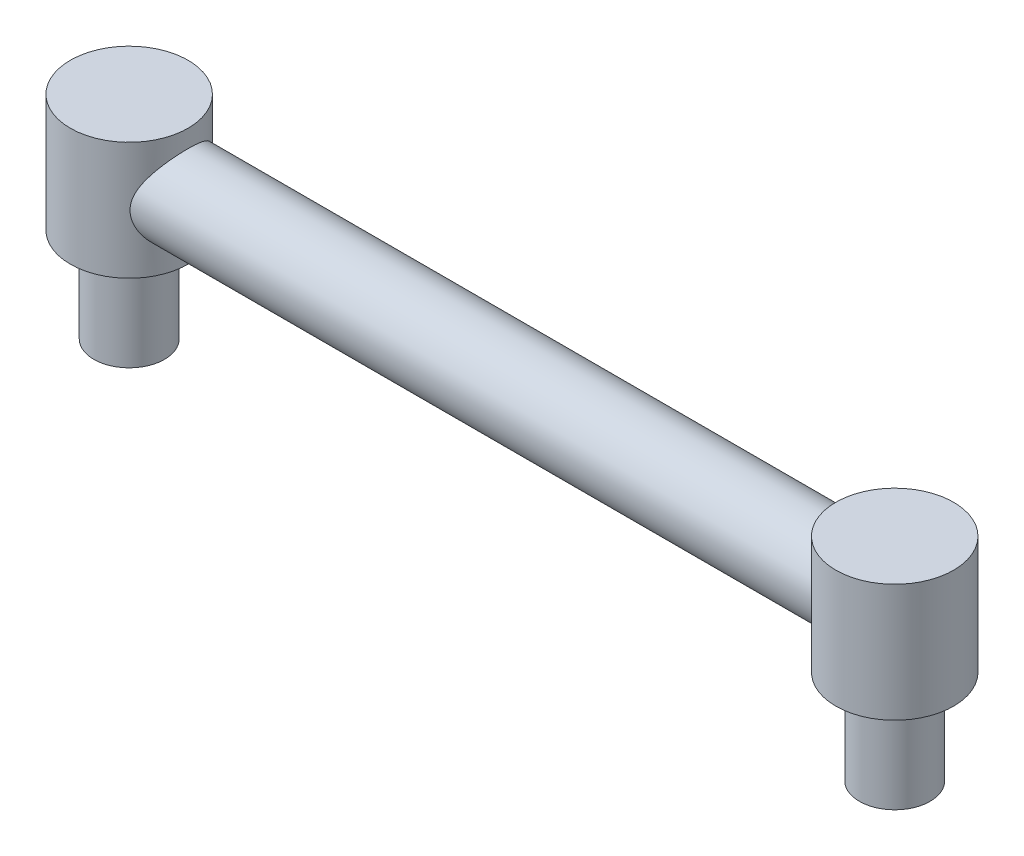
ISO-10303-21;
HEADER;
FILE_DESCRIPTION(('STEP AP214'),'2;1');
FILE_NAME('part.step','',(''),(''),'','','');
FILE_SCHEMA(('AUTOMOTIVE_DESIGN { 1 0 10303 214 1 1 1 1 }'));
ENDSEC;
DATA;
#1=APPLICATION_CONTEXT('core data for automotive mechanical design processes');
#2=APPLICATION_PROTOCOL_DEFINITION('international standard','automotive_design',2000,#1);
#3=PRODUCT_CONTEXT('',#1,'mechanical');
#4=PRODUCT('Part','Part','',(#3));
#5=PRODUCT_RELATED_PRODUCT_CATEGORY('part','',(#4));
#6=PRODUCT_DEFINITION_FORMATION('','',#4);
#7=PRODUCT_DEFINITION_CONTEXT('part definition',#1,'design');
#8=PRODUCT_DEFINITION('design','',#6,#7);
#9=PRODUCT_DEFINITION_SHAPE('','',#8);
#10=(LENGTH_UNIT() NAMED_UNIT(*) SI_UNIT(.MILLI.,.METRE.));
#11=(NAMED_UNIT(*) PLANE_ANGLE_UNIT() SI_UNIT($,.RADIAN.));
#12=(NAMED_UNIT(*) SI_UNIT($,.STERADIAN.) SOLID_ANGLE_UNIT());
#13=UNCERTAINTY_MEASURE_WITH_UNIT(LENGTH_MEASURE(1.E-05),#10,'distance_accuracy_value','');
#14=(GEOMETRIC_REPRESENTATION_CONTEXT(3) GLOBAL_UNCERTAINTY_ASSIGNED_CONTEXT((#13)) GLOBAL_UNIT_ASSIGNED_CONTEXT((#10,
#11,#12)) REPRESENTATION_CONTEXT('',''));
#15=CARTESIAN_POINT('',(0.,0.,0.));
#16=DIRECTION('',(0.,0.,1.));
#17=DIRECTION('',(1.,0.,0.));
#18=AXIS2_PLACEMENT_3D('',#15,#16,#17);
#19=CARTESIAN_POINT('',(65.,0.,0.));
#20=DIRECTION('',(-1.,0.,0.));
#21=DIRECTION('',(0.,0.,1.));
#22=AXIS2_PLACEMENT_3D('',#19,#20,#21);
#23=CYLINDRICAL_SURFACE('',#22,3.5);
#24=CARTESIAN_POINT('',(61.4292857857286,0.,3.5));
#25=CARTESIAN_POINT('',(61.4292855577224,-0.0840116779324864,3.49999986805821));
#26=CARTESIAN_POINT('',(61.4263065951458,-0.168028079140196,3.49696837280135));
#27=CARTESIAN_POINT('',(61.4145552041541,-0.335221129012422,3.48491820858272));
#28=CARTESIAN_POINT('',(61.4057820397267,-0.418397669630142,3.47589877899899));
#29=CARTESIAN_POINT('',(61.3828796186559,-0.583301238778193,3.45205902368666));
#30=CARTESIAN_POINT('',(61.3687414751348,-0.665025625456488,3.43722907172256));
#31=CARTESIAN_POINT('',(61.3357709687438,-0.826329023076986,3.4020589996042));
#32=CARTESIAN_POINT('',(61.3169360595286,-0.905906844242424,3.38171588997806));
#33=CARTESIAN_POINT('',(61.2550162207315,-1.13891610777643,3.31343273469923));
#34=CARTESIAN_POINT('',(61.2061981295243,-1.28866920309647,3.25792983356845));
#35=CARTESIAN_POINT('',(61.0991259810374,-1.5762979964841,3.12892878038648));
#36=CARTESIAN_POINT('',(61.0408712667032,-1.71417286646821,3.05542937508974));
#37=CARTESIAN_POINT('',(60.90930170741,-2.00068057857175,2.8775800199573));
#38=CARTESIAN_POINT('',(60.8351360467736,-2.14696903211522,2.77008151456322));
#39=CARTESIAN_POINT('',(60.6871482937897,-2.42158246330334,2.533533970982));
#40=CARTESIAN_POINT('',(60.6133267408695,-2.54988496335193,2.40445840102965));
#41=CARTESIAN_POINT('',(60.5013016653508,-2.73702564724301,2.18404386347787));
#42=CARTESIAN_POINT('',(60.4610559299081,-2.80255801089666,2.09934275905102));
#43=CARTESIAN_POINT('',(60.3837209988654,-2.92615122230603,1.92332930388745));
#44=CARTESIAN_POINT('',(60.3466303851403,-2.98421543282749,1.8320199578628));
#45=CARTESIAN_POINT('',(60.2766871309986,-3.09214650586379,1.64329666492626));
#46=CARTESIAN_POINT('',(60.2438289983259,-3.14202401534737,1.5458908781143));
#47=CARTESIAN_POINT('',(60.1833122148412,-3.23289758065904,1.34554036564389));
#48=CARTESIAN_POINT('',(60.1556513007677,-3.27389750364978,1.24259807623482));
#49=CARTESIAN_POINT('',(60.0951160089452,-3.36294664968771,0.983360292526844));
#50=CARTESIAN_POINT('',(60.0656995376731,-3.40555834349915,0.824311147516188));
#51=CARTESIAN_POINT('',(60.022360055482,-3.46805516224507,0.499863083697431));
#52=CARTESIAN_POINT('',(60.0084246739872,-3.48795843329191,0.334469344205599));
#53=CARTESIAN_POINT('',(59.9972246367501,-3.50396874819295,0.00161744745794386));
#54=CARTESIAN_POINT('',(59.9999923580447,-3.50002957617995,-0.165844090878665));
#55=CARTESIAN_POINT('',(60.0220277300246,-3.46847694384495,-0.497418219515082));
#56=CARTESIAN_POINT('',(60.0412999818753,-3.44085688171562,-0.661529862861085));
#57=CARTESIAN_POINT('',(60.0940482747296,-3.36438776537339,-0.978182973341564));
#58=CARTESIAN_POINT('',(60.1271901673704,-3.3160375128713,-1.13090300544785));
#59=CARTESIAN_POINT('',(60.2051516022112,-3.20037374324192,-1.42573235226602));
#60=CARTESIAN_POINT('',(60.249973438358,-3.13305650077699,-1.56783957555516));
#61=CARTESIAN_POINT('',(60.3539486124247,-2.97319649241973,-1.85472986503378));
#62=CARTESIAN_POINT('',(60.4141458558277,-2.87867047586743,-1.9980230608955));
#63=CARTESIAN_POINT('',(60.5412738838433,-2.67150358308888,-2.26760327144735));
#64=CARTESIAN_POINT('',(60.6082118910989,-2.55884319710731,-2.39387169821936));
#65=CARTESIAN_POINT('',(60.7565919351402,-2.29573767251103,-2.64933768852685));
#66=CARTESIAN_POINT('',(60.8384892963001,-2.14213778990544,-2.7750310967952));
#67=CARTESIAN_POINT('',(60.9974314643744,-1.8141470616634,-2.9997251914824));
#68=CARTESIAN_POINT('',(61.0744775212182,-1.63976160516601,-3.09873277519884));
#69=CARTESIAN_POINT('',(61.1973379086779,-1.31428904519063,-3.24758768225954));
#70=CARTESIAN_POINT('',(61.2462528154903,-1.16716049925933,-3.30350993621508));
#71=CARTESIAN_POINT('',(61.3293938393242,-0.862869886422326,-3.39566741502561));
#72=CARTESIAN_POINT('',(61.363647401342,-0.705727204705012,-3.4319394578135));
#73=CARTESIAN_POINT('',(61.4001140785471,-0.464387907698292,-3.47003079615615));
#74=CARTESIAN_POINT('',(61.4097956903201,-0.382521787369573,-3.48001777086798));
#75=CARTESIAN_POINT('',(61.4235849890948,-0.217838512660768,-3.49418953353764));
#76=CARTESIAN_POINT('',(61.4276954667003,-0.135021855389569,-3.49837722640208));
#77=CARTESIAN_POINT('',(61.4301153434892,0.0307797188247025,-3.50084655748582));
#78=CARTESIAN_POINT('',(61.428425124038,0.113764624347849,-3.49912858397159));
#79=CARTESIAN_POINT('',(61.4193502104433,0.27906823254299,-3.48984003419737));
#80=CARTESIAN_POINT('',(61.4119657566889,0.361386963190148,-3.48226970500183));
#81=CARTESIAN_POINT('',(61.384602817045,0.583474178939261,-3.4539187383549));
#82=CARTESIAN_POINT('',(61.3593847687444,0.721933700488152,-3.42755118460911));
#83=CARTESIAN_POINT('',(61.2964061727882,0.991952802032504,-3.35939166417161));
#84=CARTESIAN_POINT('',(61.2586324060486,1.12350493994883,-3.31758343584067));
#85=CARTESIAN_POINT('',(61.1545140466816,1.43844585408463,-3.19705702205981));
#86=CARTESIAN_POINT('',(61.0830929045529,1.61706048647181,-3.11022921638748));
#87=CARTESIAN_POINT('',(60.9320088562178,1.95485779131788,-2.90985386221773));
#88=CARTESIAN_POINT('',(60.8523300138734,2.11400154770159,-2.79625408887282));
#89=CARTESIAN_POINT('',(60.6916260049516,2.4142081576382,-2.54184750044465));
#90=CARTESIAN_POINT('',(60.6106038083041,2.5548731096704,-2.40056769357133));
#91=CARTESIAN_POINT('',(60.4562932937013,2.81172054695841,-2.09383690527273));
#92=CARTESIAN_POINT('',(60.3829937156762,2.92793893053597,-1.92842197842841));
#93=CARTESIAN_POINT('',(60.2616047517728,3.11554550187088,-1.60391474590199));
#94=CARTESIAN_POINT('',(60.2113563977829,3.19113943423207,-1.44809589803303));
#95=CARTESIAN_POINT('',(60.1466046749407,3.28724745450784,-1.20483682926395));
#96=CARTESIAN_POINT('',(60.1267869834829,3.31640852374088,-1.12213837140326));
#97=CARTESIAN_POINT('',(60.0911081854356,3.36861764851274,-0.954017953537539));
#98=CARTESIAN_POINT('',(60.0752453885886,3.39166831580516,-0.868597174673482));
#99=CARTESIAN_POINT('',(60.047760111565,3.43145562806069,-0.695045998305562));
#100=CARTESIAN_POINT('',(60.0361649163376,3.44815166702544,-0.606901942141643));
#101=CARTESIAN_POINT('',(60.0176497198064,3.47475258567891,-0.429146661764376));
#102=CARTESIAN_POINT('',(60.0107276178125,3.48466051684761,-0.339536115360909));
#103=CARTESIAN_POINT('',(60.0017357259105,3.49752312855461,-0.159574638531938));
#104=CARTESIAN_POINT('',(59.9996655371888,3.50047838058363,-0.069223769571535));
#105=CARTESIAN_POINT('',(60.0004233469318,3.49939464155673,0.111386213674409));
#106=CARTESIAN_POINT('',(60.0032509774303,3.49535617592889,0.201645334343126));
#107=CARTESIAN_POINT('',(60.0179880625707,3.47427171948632,0.453706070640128));
#108=CARTESIAN_POINT('',(60.0353750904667,3.44937301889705,0.614624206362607));
#109=CARTESIAN_POINT('',(60.0845217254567,3.37825020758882,0.929254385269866));
#110=CARTESIAN_POINT('',(60.1162840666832,3.33202204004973,1.08296505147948));
#111=CARTESIAN_POINT('',(60.1931052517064,3.21839303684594,1.3852515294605));
#112=CARTESIAN_POINT('',(60.2385906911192,3.15030758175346,1.53345914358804));
#113=CARTESIAN_POINT('',(60.3392077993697,2.99606380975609,1.81648395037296));
#114=CARTESIAN_POINT('',(60.3943413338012,2.90990199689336,1.9512985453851));
#115=CARTESIAN_POINT('',(60.5200142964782,2.70695427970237,2.22620599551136));
#116=CARTESIAN_POINT('',(60.5916146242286,2.58748644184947,2.36382741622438));
#117=CARTESIAN_POINT('',(60.7379606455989,2.32945012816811,2.61851490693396));
#118=CARTESIAN_POINT('',(60.8127126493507,2.19084193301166,2.73553705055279));
#119=CARTESIAN_POINT('',(60.9282220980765,1.95826810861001,2.90279164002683));
#120=CARTESIAN_POINT('',(60.9700456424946,1.87006627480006,2.96040527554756));
#121=CARTESIAN_POINT('',(61.0512444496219,1.68799665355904,3.06787708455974));
#122=CARTESIAN_POINT('',(61.0906190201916,1.59412727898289,3.11773307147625));
#123=CARTESIAN_POINT('',(61.2025290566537,1.30472529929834,3.25469370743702));
#124=CARTESIAN_POINT('',(61.2692278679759,1.10068833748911,3.32970789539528));
#125=CARTESIAN_POINT('',(61.35491203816,0.745417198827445,3.42286407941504));
#126=CARTESIAN_POINT('',(61.3823813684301,0.599023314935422,3.45160892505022));
#127=CARTESIAN_POINT('',(61.4102990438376,0.376071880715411,3.48054616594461));
#128=CARTESIAN_POINT('',(61.4173904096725,0.301217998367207,3.48782851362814));
#129=CARTESIAN_POINT('',(61.4268831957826,0.150910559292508,3.49755478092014));
#130=CARTESIAN_POINT('',(61.429285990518,0.0754571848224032,3.50000011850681));
#131=CARTESIAN_POINT('',(61.4292857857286,0.,3.5));
#132=B_SPLINE_CURVE_WITH_KNOTS('',3,(#24,#25,#26,#27,#28,#29,#30,#31,#32,#33,#34,#35,#36,#37,
#38,#39,#40,#41,#42,#43,#44,#45,#46,#47,#48,#49,#50,#51,#52,#53,#54,#55,#56,#57,#58,#59,#60,#61,
#62,#63,#64,#65,#66,#67,#68,#69,#70,#71,#72,#73,#74,#75,#76,#77,#78,#79,#80,#81,#82,#83,#84,#85,
#86,#87,#88,#89,#90,#91,#92,#93,#94,#95,#96,#97,#98,#99,#100,#101,#102,#103,#104,#105,#106,#107,
#108,#109,#110,#111,#112,#113,#114,#115,#116,#117,#118,#119,#120,#121,#122,#123,#124,#125,#126,
#127,#128,#129,#130,#131),.UNSPECIFIED.,.T.,.F.,(4,2,2,2,2,2,2,2,2,2,2,2,2,2,2,2,2,2,2,2,2,2,2,
2,2,2,2,2,2,2,2,2,2,2,2,2,2,2,2,2,2,2,2,2,2,2,2,2,2,2,2,2,2,4),(0.,0.251937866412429,
0.503907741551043,0.756296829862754,1.00882304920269,1.50767705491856,2.00656580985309,
2.5928214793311,3.17980340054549,3.52260937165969,3.86526043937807,4.20746228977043,
4.54951477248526,5.04896295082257,5.54801174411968,6.04802819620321,6.54818408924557,
7.03692702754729,7.52576602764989,8.06947174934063,8.61376637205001,9.25526677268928,
9.89660120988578,10.3893951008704,10.8812624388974,11.1300434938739,11.3786998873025,
11.6273399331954,11.8759694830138,12.303607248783,12.7316966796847,13.3614491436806,
13.9924404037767,14.6353397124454,15.2772882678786,15.8158328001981,16.0852507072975,
16.3545532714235,16.6255488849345,16.8964225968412,17.1672740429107,17.4381051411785,
17.9269002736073,18.4157884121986,18.9217932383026,19.4278960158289,20.0131431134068,
20.5996234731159,20.939266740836,21.2790055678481,21.9556531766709,22.4086307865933,
22.6349814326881,22.8612657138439),.UNSPECIFIED.);
#133=CARTESIAN_POINT('',(61.4292857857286,0.,3.5));
#134=VERTEX_POINT('',#133);
#135=EDGE_CURVE('E77',#134,#134,#132,.T.);
#136=ORIENTED_EDGE('',*,*,#135,.F.);
#137=EDGE_LOOP('',(#136));
#138=FACE_BOUND('',#137,.T.);
#139=CARTESIAN_POINT('',(3.57071421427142,0.,3.5));
#140=CARTESIAN_POINT('',(3.57071444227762,0.0840116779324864,3.49999986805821));
#141=CARTESIAN_POINT('',(3.57369340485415,0.168028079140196,3.49696837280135));
#142=CARTESIAN_POINT('',(3.58544479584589,0.335221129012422,3.48491820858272));
#143=CARTESIAN_POINT('',(3.59421796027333,0.418397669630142,3.47589877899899));
#144=CARTESIAN_POINT('',(3.61712038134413,0.583301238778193,3.45205902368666));
#145=CARTESIAN_POINT('',(3.63125852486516,0.665025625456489,3.43722907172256));
#146=CARTESIAN_POINT('',(3.66422903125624,0.826329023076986,3.4020589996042));
#147=CARTESIAN_POINT('',(3.68306394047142,0.905906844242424,3.38171588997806));
#148=CARTESIAN_POINT('',(3.74498377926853,1.13891610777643,3.31343273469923));
#149=CARTESIAN_POINT('',(3.79380187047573,1.28866920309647,3.25792983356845));
#150=CARTESIAN_POINT('',(3.90087401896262,1.5762979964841,3.12892878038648));
#151=CARTESIAN_POINT('',(3.95912873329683,1.71417286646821,3.05542937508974));
#152=CARTESIAN_POINT('',(4.09069829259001,2.00068057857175,2.8775800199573));
#153=CARTESIAN_POINT('',(4.1648639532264,2.14696903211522,2.77008151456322));
#154=CARTESIAN_POINT('',(4.31285170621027,2.42158246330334,2.533533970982));
#155=CARTESIAN_POINT('',(4.38667325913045,2.54988496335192,2.40445840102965));
#156=CARTESIAN_POINT('',(4.49869833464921,2.73702564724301,2.18404386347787));
#157=CARTESIAN_POINT('',(4.53894407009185,2.80255801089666,2.09934275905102));
#158=CARTESIAN_POINT('',(4.61627900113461,2.92615122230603,1.92332930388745));
#159=CARTESIAN_POINT('',(4.65336961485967,2.98421543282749,1.83201995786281));
#160=CARTESIAN_POINT('',(4.72331286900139,3.09214650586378,1.64329666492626));
#161=CARTESIAN_POINT('',(4.75617100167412,3.14202401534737,1.5458908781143));
#162=CARTESIAN_POINT('',(4.81668778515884,3.23289758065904,1.34554036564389));
#163=CARTESIAN_POINT('',(4.8443486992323,3.27389750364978,1.24259807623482));
#164=CARTESIAN_POINT('',(4.90488399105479,3.36294664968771,0.983360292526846));
#165=CARTESIAN_POINT('',(4.9343004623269,3.40555834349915,0.824311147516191));
#166=CARTESIAN_POINT('',(4.97763994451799,3.46805516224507,0.499863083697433));
#167=CARTESIAN_POINT('',(4.9915753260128,3.48795843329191,0.334469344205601));
#168=CARTESIAN_POINT('',(5.00277536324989,3.50396874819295,0.00161744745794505));
#169=CARTESIAN_POINT('',(5.00000764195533,3.50002957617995,-0.165844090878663));
#170=CARTESIAN_POINT('',(4.9779722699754,3.46847694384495,-0.497418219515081));
#171=CARTESIAN_POINT('',(4.95870001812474,3.44085688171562,-0.661529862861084));
#172=CARTESIAN_POINT('',(4.90595172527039,3.36438776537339,-0.978182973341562));
#173=CARTESIAN_POINT('',(4.87280983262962,3.31603751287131,-1.13090300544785));
#174=CARTESIAN_POINT('',(4.79484839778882,3.20037374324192,-1.42573235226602));
#175=CARTESIAN_POINT('',(4.75002656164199,3.13305650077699,-1.56783957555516));
#176=CARTESIAN_POINT('',(4.64605138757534,2.97319649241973,-1.85472986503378));
#177=CARTESIAN_POINT('',(4.58585414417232,2.87867047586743,-1.9980230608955));
#178=CARTESIAN_POINT('',(4.45872611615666,2.67150358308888,-2.26760327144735));
#179=CARTESIAN_POINT('',(4.39178810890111,2.55884319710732,-2.39387169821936));
#180=CARTESIAN_POINT('',(4.24340806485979,2.29573767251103,-2.64933768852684));
#181=CARTESIAN_POINT('',(4.16151070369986,2.14213778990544,-2.77503109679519));
#182=CARTESIAN_POINT('',(4.00256853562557,1.8141470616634,-2.9997251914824));
#183=CARTESIAN_POINT('',(3.92552247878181,1.63976160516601,-3.09873277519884));
#184=CARTESIAN_POINT('',(3.80266209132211,1.31428904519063,-3.24758768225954));
#185=CARTESIAN_POINT('',(3.75374718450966,1.16716049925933,-3.30350993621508));
#186=CARTESIAN_POINT('',(3.67060616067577,0.862869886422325,-3.39566741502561));
#187=CARTESIAN_POINT('',(3.63635259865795,0.705727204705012,-3.4319394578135));
#188=CARTESIAN_POINT('',(3.59988592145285,0.464387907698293,-3.47003079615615));
#189=CARTESIAN_POINT('',(3.59020430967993,0.382521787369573,-3.48001777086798));
#190=CARTESIAN_POINT('',(3.57641501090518,0.217838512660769,-3.49418953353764));
#191=CARTESIAN_POINT('',(3.57230453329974,0.13502185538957,-3.49837722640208));
#192=CARTESIAN_POINT('',(3.56988465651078,-0.0307797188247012,-3.50084655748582));
#193=CARTESIAN_POINT('',(3.57157487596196,-0.113764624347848,-3.49912858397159));
#194=CARTESIAN_POINT('',(3.5806497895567,-0.279068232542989,-3.48984003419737));
#195=CARTESIAN_POINT('',(3.58803424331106,-0.361386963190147,-3.48226970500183));
#196=CARTESIAN_POINT('',(3.61539718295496,-0.58347417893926,-3.4539187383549));
#197=CARTESIAN_POINT('',(3.64061523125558,-0.721933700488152,-3.42755118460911));
#198=CARTESIAN_POINT('',(3.70359382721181,-0.991952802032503,-3.35939166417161));
#199=CARTESIAN_POINT('',(3.74136759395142,-1.12350493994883,-3.31758343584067));
#200=CARTESIAN_POINT('',(3.84548595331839,-1.43844585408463,-3.19705702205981));
#201=CARTESIAN_POINT('',(3.91690709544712,-1.6170604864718,-3.11022921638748));
#202=CARTESIAN_POINT('',(4.0679911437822,-1.95485779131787,-2.90985386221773));
#203=CARTESIAN_POINT('',(4.14766998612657,-2.11400154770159,-2.79625408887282));
#204=CARTESIAN_POINT('',(4.30837399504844,-2.4142081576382,-2.54184750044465));
#205=CARTESIAN_POINT('',(4.38939619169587,-2.5548731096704,-2.40056769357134));
#206=CARTESIAN_POINT('',(4.54370670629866,-2.81172054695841,-2.09383690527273));
#207=CARTESIAN_POINT('',(4.61700628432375,-2.92793893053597,-1.92842197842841));
#208=CARTESIAN_POINT('',(4.73839524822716,-3.11554550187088,-1.60391474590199));
#209=CARTESIAN_POINT('',(4.78864360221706,-3.19113943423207,-1.44809589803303));
#210=CARTESIAN_POINT('',(4.85339532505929,-3.28724745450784,-1.20483682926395));
#211=CARTESIAN_POINT('',(4.87321301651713,-3.31640852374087,-1.12213837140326));
#212=CARTESIAN_POINT('',(4.90889181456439,-3.36861764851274,-0.954017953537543));
#213=CARTESIAN_POINT('',(4.92475461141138,-3.39166831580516,-0.868597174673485));
#214=CARTESIAN_POINT('',(4.95223988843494,-3.43145562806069,-0.695045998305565));
#215=CARTESIAN_POINT('',(4.96383508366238,-3.44815166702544,-0.606901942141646));
#216=CARTESIAN_POINT('',(4.98235028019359,-3.47475258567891,-0.42914666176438));
#217=CARTESIAN_POINT('',(4.98927238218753,-3.48466051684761,-0.339536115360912));
#218=CARTESIAN_POINT('',(4.99826427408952,-3.49752312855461,-0.15957463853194));
#219=CARTESIAN_POINT('',(5.00033446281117,-3.50047838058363,-0.0692237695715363));
#220=CARTESIAN_POINT('',(4.99957665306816,-3.49939464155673,0.111386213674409));
#221=CARTESIAN_POINT('',(4.99674902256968,-3.49535617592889,0.201645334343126));
#222=CARTESIAN_POINT('',(4.98201193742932,-3.47427171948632,0.453706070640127));
#223=CARTESIAN_POINT('',(4.96462490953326,-3.44937301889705,0.614624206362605));
#224=CARTESIAN_POINT('',(4.91547827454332,-3.37825020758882,0.929254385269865));
#225=CARTESIAN_POINT('',(4.88371593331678,-3.33202204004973,1.08296505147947));
#226=CARTESIAN_POINT('',(4.80689474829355,-3.21839303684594,1.3852515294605));
#227=CARTESIAN_POINT('',(4.76140930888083,-3.15030758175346,1.53345914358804));
#228=CARTESIAN_POINT('',(4.6607922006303,-2.99606380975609,1.81648395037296));
#229=CARTESIAN_POINT('',(4.60565866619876,-2.90990199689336,1.9512985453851));
#230=CARTESIAN_POINT('',(4.47998570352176,-2.70695427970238,2.22620599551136));
#231=CARTESIAN_POINT('',(4.40838537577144,-2.58748644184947,2.36382741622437));
#232=CARTESIAN_POINT('',(4.26203935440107,-2.32945012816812,2.61851490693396));
#233=CARTESIAN_POINT('',(4.18728735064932,-2.19084193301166,2.73553705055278));
#234=CARTESIAN_POINT('',(4.07177790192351,-1.95826810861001,2.90279164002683));
#235=CARTESIAN_POINT('',(4.02995435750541,-1.87006627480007,2.96040527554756));
#236=CARTESIAN_POINT('',(3.94875555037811,-1.68799665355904,3.06787708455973));
#237=CARTESIAN_POINT('',(3.90938097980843,-1.59412727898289,3.11773307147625));
#238=CARTESIAN_POINT('',(3.79747094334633,-1.30472529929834,3.25469370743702));
#239=CARTESIAN_POINT('',(3.73077213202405,-1.10068833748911,3.32970789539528));
#240=CARTESIAN_POINT('',(3.64508796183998,-0.745417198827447,3.42286407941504));
#241=CARTESIAN_POINT('',(3.61761863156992,-0.599023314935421,3.45160892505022));
#242=CARTESIAN_POINT('',(3.5897009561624,-0.37607188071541,3.48054616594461));
#243=CARTESIAN_POINT('',(3.58260959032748,-0.301217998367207,3.48782851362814));
#244=CARTESIAN_POINT('',(3.57311680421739,-0.150910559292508,3.49755478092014));
#245=CARTESIAN_POINT('',(3.57071400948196,-0.075457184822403,3.50000011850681));
#246=CARTESIAN_POINT('',(3.57071421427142,0.,3.5));
#247=B_SPLINE_CURVE_WITH_KNOTS('',3,(#139,#140,#141,#142,#143,#144,#145,#146,#147,#148,#149,
#150,#151,#152,#153,#154,#155,#156,#157,#158,#159,#160,#161,#162,#163,#164,#165,#166,#167,#168,
#169,#170,#171,#172,#173,#174,#175,#176,#177,#178,#179,#180,#181,#182,#183,#184,#185,#186,#187,
#188,#189,#190,#191,#192,#193,#194,#195,#196,#197,#198,#199,#200,#201,#202,#203,#204,#205,#206,
#207,#208,#209,#210,#211,#212,#213,#214,#215,#216,#217,#218,#219,#220,#221,#222,#223,#224,#225,
#226,#227,#228,#229,#230,#231,#232,#233,#234,#235,#236,#237,#238,#239,#240,#241,#242,#243,#244,
#245,#246),.UNSPECIFIED.,.T.,.F.,(4,2,2,2,2,2,2,2,2,2,2,2,2,2,2,2,2,2,2,2,2,2,2,2,2,2,2,2,2,2,2,
2,2,2,2,2,2,2,2,2,2,2,2,2,2,2,2,2,2,2,2,2,2,4),(0.,0.25193786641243,0.503907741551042,
0.756296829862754,1.00882304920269,1.50767705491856,2.00656580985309,2.5928214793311,
3.17980340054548,3.52260937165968,3.86526043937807,4.20746228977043,4.54951477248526,
5.04896295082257,5.54801174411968,6.04802819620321,6.54818408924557,7.03692702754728,
7.52576602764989,8.06947174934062,8.61376637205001,9.25526677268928,9.89660120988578,
10.3893951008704,10.8812624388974,11.1300434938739,11.3786998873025,11.6273399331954,
11.8759694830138,12.303607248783,12.7316966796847,13.3614491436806,13.9924404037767,
14.6353397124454,15.2772882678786,15.8158328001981,16.0852507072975,16.3545532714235,
16.6255488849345,16.8964225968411,17.1672740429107,17.4381051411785,17.9269002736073,
18.4157884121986,18.9217932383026,19.4278960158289,20.0131431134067,20.5996234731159,
20.939266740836,21.2790055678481,21.9556531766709,22.4086307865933,22.6349814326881,
22.8612657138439),.UNSPECIFIED.);
#248=CARTESIAN_POINT('',(3.57071421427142,0.,3.5));
#249=VERTEX_POINT('',#248);
#250=EDGE_CURVE('E41',#249,#249,#247,.T.);
#251=ORIENTED_EDGE('',*,*,#250,.F.);
#252=EDGE_LOOP('',(#251));
#253=FACE_BOUND('',#252,.T.);
#254=ADVANCED_FACE('F37',(#138,#253),#23,.T.);
#255=CARTESIAN_POINT('',(65.,5.,0.));
#256=DIRECTION('',(0.,-1.,0.));
#257=DIRECTION('',(0.,0.,-1.));
#258=AXIS2_PLACEMENT_3D('',#255,#256,#257);
#259=CYLINDRICAL_SURFACE('',#258,5.);
#260=CARTESIAN_POINT('',(65.,-5.,0.));
#261=DIRECTION('',(0.,1.,0.));
#262=DIRECTION('',(0.,0.,1.));
#263=AXIS2_PLACEMENT_3D('',#260,#261,#262);
#264=CIRCLE('',#263,5.);
#265=CARTESIAN_POINT('',(65.,-5.,5.));
#266=VERTEX_POINT('',#265);
#267=EDGE_CURVE('E69',#266,#266,#264,.T.);
#268=ORIENTED_EDGE('',*,*,#267,.T.);
#269=EDGE_LOOP('',(#268));
#270=FACE_BOUND('',#269,.T.);
#271=CARTESIAN_POINT('',(65.,5.,0.));
#272=DIRECTION('',(0.,1.,0.));
#273=DIRECTION('',(0.,0.,1.));
#274=AXIS2_PLACEMENT_3D('',#271,#272,#273);
#275=CIRCLE('',#274,5.);
#276=CARTESIAN_POINT('',(65.,5.,5.));
#277=VERTEX_POINT('',#276);
#278=EDGE_CURVE('E73',#277,#277,#275,.T.);
#279=ORIENTED_EDGE('',*,*,#278,.F.);
#280=EDGE_LOOP('',(#279));
#281=FACE_BOUND('',#280,.T.);
#282=ORIENTED_EDGE('',*,*,#135,.T.);
#283=EDGE_LOOP('',(#282));
#284=FACE_BOUND('',#283,.T.);
#285=ADVANCED_FACE('F85',(#270,#281,#284),#259,.T.);
#286=CARTESIAN_POINT('',(65.,5.,0.));
#287=DIRECTION('',(0.,1.,0.));
#288=DIRECTION('',(0.,0.,1.));
#289=AXIS2_PLACEMENT_3D('',#286,#287,#288);
#290=PLANE('',#289);
#291=ORIENTED_EDGE('',*,*,#278,.T.);
#292=EDGE_LOOP('',(#291));
#293=FACE_BOUND('',#292,.T.);
#294=ADVANCED_FACE('F89',(#293),#290,.T.);
#295=CARTESIAN_POINT('',(65.,-5.,0.));
#296=DIRECTION('',(0.,1.,0.));
#297=DIRECTION('',(0.,0.,1.));
#298=AXIS2_PLACEMENT_3D('',#295,#296,#297);
#299=PLANE('',#298);
#300=CARTESIAN_POINT('',(65.,-5.,0.));
#301=DIRECTION('',(0.,-1.,0.));
#302=DIRECTION('',(0.,0.,-1.));
#303=AXIS2_PLACEMENT_3D('',#300,#301,#302);
#304=CIRCLE('',#303,3.00000000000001);
#305=CARTESIAN_POINT('',(65.,-5.,-3.00000000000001));
#306=VERTEX_POINT('',#305);
#307=EDGE_CURVE('E50',#306,#306,#304,.T.);
#308=ORIENTED_EDGE('',*,*,#307,.F.);
#309=EDGE_LOOP('',(#308));
#310=FACE_BOUND('',#309,.T.);
#311=ORIENTED_EDGE('',*,*,#267,.F.);
#312=EDGE_LOOP('',(#311));
#313=FACE_BOUND('',#312,.T.);
#314=ADVANCED_FACE('F91',(#310,#313),#299,.F.);
#315=CARTESIAN_POINT('',(0.,5.,0.));
#316=DIRECTION('',(0.,-1.,0.));
#317=DIRECTION('',(0.,0.,-1.));
#318=AXIS2_PLACEMENT_3D('',#315,#316,#317);
#319=CYLINDRICAL_SURFACE('',#318,5.);
#320=CARTESIAN_POINT('',(0.,-5.,0.));
#321=DIRECTION('',(0.,1.,0.));
#322=DIRECTION('',(0.,0.,1.));
#323=AXIS2_PLACEMENT_3D('',#320,#321,#322);
#324=CIRCLE('',#323,5.);
#325=CARTESIAN_POINT('',(0.,-5.,5.));
#326=VERTEX_POINT('',#325);
#327=EDGE_CURVE('E63',#326,#326,#324,.T.);
#328=ORIENTED_EDGE('',*,*,#327,.T.);
#329=EDGE_LOOP('',(#328));
#330=FACE_BOUND('',#329,.T.);
#331=CARTESIAN_POINT('',(0.,5.,0.));
#332=DIRECTION('',(0.,1.,0.));
#333=DIRECTION('',(0.,0.,1.));
#334=AXIS2_PLACEMENT_3D('',#331,#332,#333);
#335=CIRCLE('',#334,5.);
#336=CARTESIAN_POINT('',(0.,5.,5.));
#337=VERTEX_POINT('',#336);
#338=EDGE_CURVE('E65',#337,#337,#335,.T.);
#339=ORIENTED_EDGE('',*,*,#338,.F.);
#340=EDGE_LOOP('',(#339));
#341=FACE_BOUND('',#340,.T.);
#342=ORIENTED_EDGE('',*,*,#250,.T.);
#343=EDGE_LOOP('',(#342));
#344=FACE_BOUND('',#343,.T.);
#345=ADVANCED_FACE('F94',(#330,#341,#344),#319,.T.);
#346=CARTESIAN_POINT('',(0.,5.,0.));
#347=DIRECTION('',(0.,1.,0.));
#348=DIRECTION('',(0.,0.,1.));
#349=AXIS2_PLACEMENT_3D('',#346,#347,#348);
#350=PLANE('',#349);
#351=ORIENTED_EDGE('',*,*,#338,.T.);
#352=EDGE_LOOP('',(#351));
#353=FACE_BOUND('',#352,.T.);
#354=ADVANCED_FACE('F101',(#353),#350,.T.);
#355=CARTESIAN_POINT('',(0.,-5.,0.));
#356=DIRECTION('',(0.,1.,0.));
#357=DIRECTION('',(0.,0.,1.));
#358=AXIS2_PLACEMENT_3D('',#355,#356,#357);
#359=PLANE('',#358);
#360=CARTESIAN_POINT('',(0.,-5.,0.));
#361=DIRECTION('',(0.,-1.,0.));
#362=DIRECTION('',(0.,0.,-1.));
#363=AXIS2_PLACEMENT_3D('',#360,#361,#362);
#364=CIRCLE('',#363,3.);
#365=CARTESIAN_POINT('',(0.,-5.,-3.));
#366=VERTEX_POINT('',#365);
#367=EDGE_CURVE('E10',#366,#366,#364,.T.);
#368=ORIENTED_EDGE('',*,*,#367,.F.);
#369=EDGE_LOOP('',(#368));
#370=FACE_BOUND('',#369,.T.);
#371=ORIENTED_EDGE('',*,*,#327,.F.);
#372=EDGE_LOOP('',(#371));
#373=FACE_BOUND('',#372,.T.);
#374=ADVANCED_FACE('F103',(#370,#373),#359,.F.);
#375=CARTESIAN_POINT('',(65.,-13.,0.));
#376=DIRECTION('',(0.,1.,0.));
#377=DIRECTION('',(0.,0.,1.));
#378=AXIS2_PLACEMENT_3D('',#375,#376,#377);
#379=CYLINDRICAL_SURFACE('',#378,3.00000000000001);
#380=CARTESIAN_POINT('',(65.,-13.,0.));
#381=DIRECTION('',(0.,-1.,0.));
#382=DIRECTION('',(0.,0.,-1.));
#383=AXIS2_PLACEMENT_3D('',#380,#381,#382);
#384=CIRCLE('',#383,3.00000000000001);
#385=CARTESIAN_POINT('',(65.,-13.,-3.00000000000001));
#386=VERTEX_POINT('',#385);
#387=EDGE_CURVE('E60',#386,#386,#384,.T.);
#388=ORIENTED_EDGE('',*,*,#387,.F.);
#389=EDGE_LOOP('',(#388));
#390=FACE_BOUND('',#389,.T.);
#391=ORIENTED_EDGE('',*,*,#307,.T.);
#392=EDGE_LOOP('',(#391));
#393=FACE_BOUND('',#392,.T.);
#394=ADVANCED_FACE('F106',(#390,#393),#379,.T.);
#395=CARTESIAN_POINT('',(65.,-13.,0.));
#396=DIRECTION('',(0.,-1.,0.));
#397=DIRECTION('',(0.,0.,-1.));
#398=AXIS2_PLACEMENT_3D('',#395,#396,#397);
#399=PLANE('',#398);
#400=ORIENTED_EDGE('',*,*,#387,.T.);
#401=EDGE_LOOP('',(#400));
#402=FACE_BOUND('',#401,.T.);
#403=ADVANCED_FACE('F113',(#402),#399,.T.);
#404=CARTESIAN_POINT('',(0.,-13.,0.));
#405=DIRECTION('',(0.,1.,0.));
#406=DIRECTION('',(0.,0.,1.));
#407=AXIS2_PLACEMENT_3D('',#404,#405,#406);
#408=CYLINDRICAL_SURFACE('',#407,3.);
#409=CARTESIAN_POINT('',(0.,-13.,0.));
#410=DIRECTION('',(0.,-1.,0.));
#411=DIRECTION('',(0.,0.,-1.));
#412=AXIS2_PLACEMENT_3D('',#409,#410,#411);
#413=CIRCLE('',#412,3.);
#414=CARTESIAN_POINT('',(0.,-13.,-3.));
#415=VERTEX_POINT('',#414);
#416=EDGE_CURVE('E59',#415,#415,#413,.T.);
#417=ORIENTED_EDGE('',*,*,#416,.F.);
#418=EDGE_LOOP('',(#417));
#419=FACE_BOUND('',#418,.T.);
#420=ORIENTED_EDGE('',*,*,#367,.T.);
#421=EDGE_LOOP('',(#420));
#422=FACE_BOUND('',#421,.T.);
#423=ADVANCED_FACE('F117',(#419,#422),#408,.T.);
#424=CARTESIAN_POINT('',(0.,-13.,0.));
#425=DIRECTION('',(0.,-1.,0.));
#426=DIRECTION('',(0.,0.,-1.));
#427=AXIS2_PLACEMENT_3D('',#424,#425,#426);
#428=PLANE('',#427);
#429=ORIENTED_EDGE('',*,*,#416,.T.);
#430=EDGE_LOOP('',(#429));
#431=FACE_BOUND('',#430,.T.);
#432=ADVANCED_FACE('F121',(#431),#428,.T.);
#433=CLOSED_SHELL('',(#254,#285,#294,#314,#345,#354,#374,#394,#403,#423,#432));
#434=MANIFOLD_SOLID_BREP('B2',#433);
#435=ADVANCED_BREP_SHAPE_REPRESENTATION('',(#18,#434),#14);
#436=SHAPE_DEFINITION_REPRESENTATION(#9,#435);
ENDSEC;
END-ISO-10303-21;
